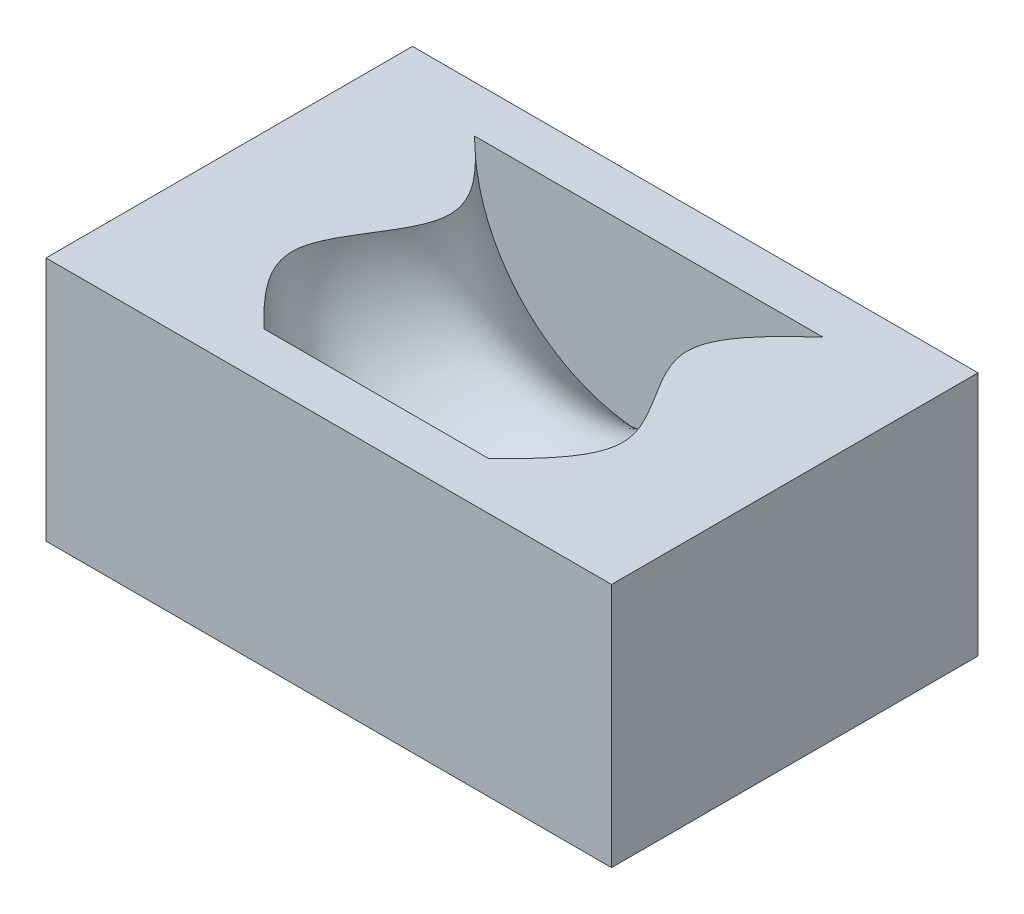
from build123d import *

# Parameters (mm, degrees)
SKETCH1_W      = 111.754758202
SKETCH1_H      = 72.421885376
EXTRUDE1_DEPTH = 48.469120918


with BuildPart() as part:
    # Sketch1 → Extrude1 (new body)
    with BuildSketch(Plane(origin=(0, 0, 0), x_dir=(1, 0, 0), z_dir=(0, 1, 0))):
        Rectangle(SKETCH1_W, SKETCH1_H)
    extrude(amount=EXTRUDE1_DEPTH)

    # Sketch2 → Cut-Revolve1 (revolve, cut)
    with BuildSketch(Plane(origin=(0, 48.469120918, 0), x_dir=(-1, 0, 0), z_dir=(0, 1, 0))):
        with BuildLine():
            Line((0, -27.00169839), (-34.419747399, -27.00169839))
            add(Edge.make_bspline(
                [(-34.419747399, -27.00169839), (-28.77226561, -21.728997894), (-16.602335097, -10.366695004), (-39.334266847, 9.682065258), (-27.669027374, 21.376519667), (-22.254147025, 26.80496128)],
                knots=[0, 0, 0, 0, 0.316908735, 0.682916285, 1, 1, 1, 1], degree=3))
            Line((-22.254147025, 26.80496128), (0, 26.80496128))
            Line((0, 26.80496128), (0, -27.00169839))
        make_face()
    revolve(axis=Axis((0, 48.469120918, 36.210942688), (0, 0, -1)), mode=Mode.SUBTRACT)


solid = part.part
